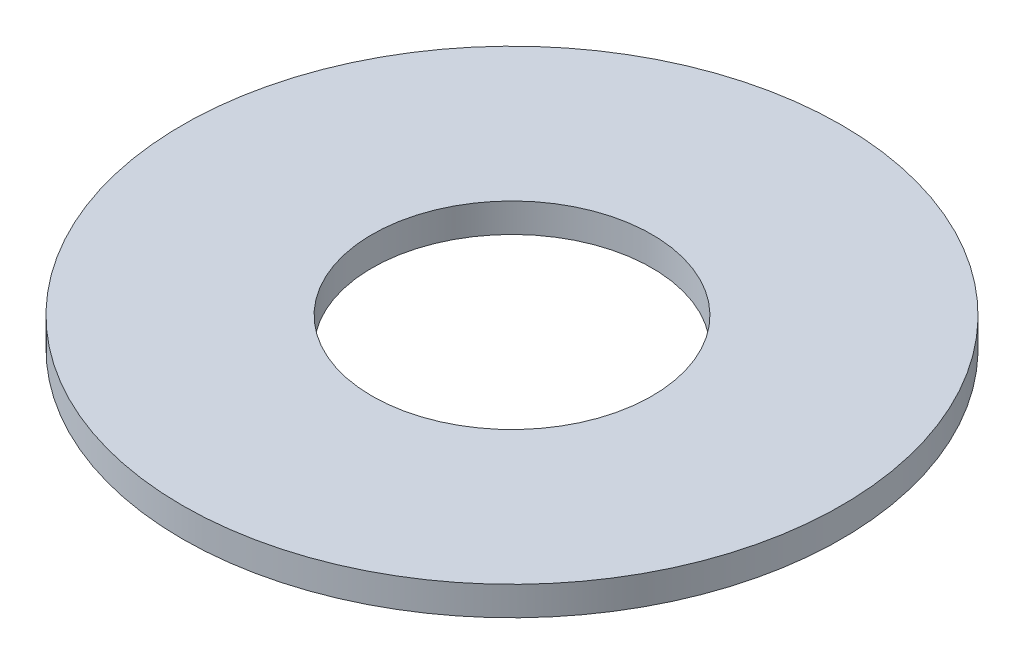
from build123d import *

# Parameters (mm, degrees)
SKETCH1_R           = 15.875
BOSS_EXTRUDE1_DEPTH = 1.397
SKETCH5_R           = 6.7437
CUT_EXTRUDE1_DEPTH  = 23.49406275


with BuildPart() as part:
    # Sketch1 → Boss-Extrude1 (new body)
    with BuildSketch(Plane(origin=(0, 0, 0), x_dir=(1, 0, 0), z_dir=(0, 1, 0))):
        with Locations(Location((0, 0, 0), (0, 0, 270))):
            Circle(SKETCH1_R)
    extrude(amount=BOSS_EXTRUDE1_DEPTH)

    # Sketch5 → Cut-Extrude1 (cut, through all)
    with BuildSketch(Plane(origin=(0, 1.397, 0), x_dir=(-1, 0, 0), z_dir=(0, 1, 0))):
        with Locations(Location((0, 0, 0), (0, 0, 90))):
            Circle(SKETCH5_R)
    extrude(amount=-CUT_EXTRUDE1_DEPTH, mode=Mode.SUBTRACT)


solid = part.part
